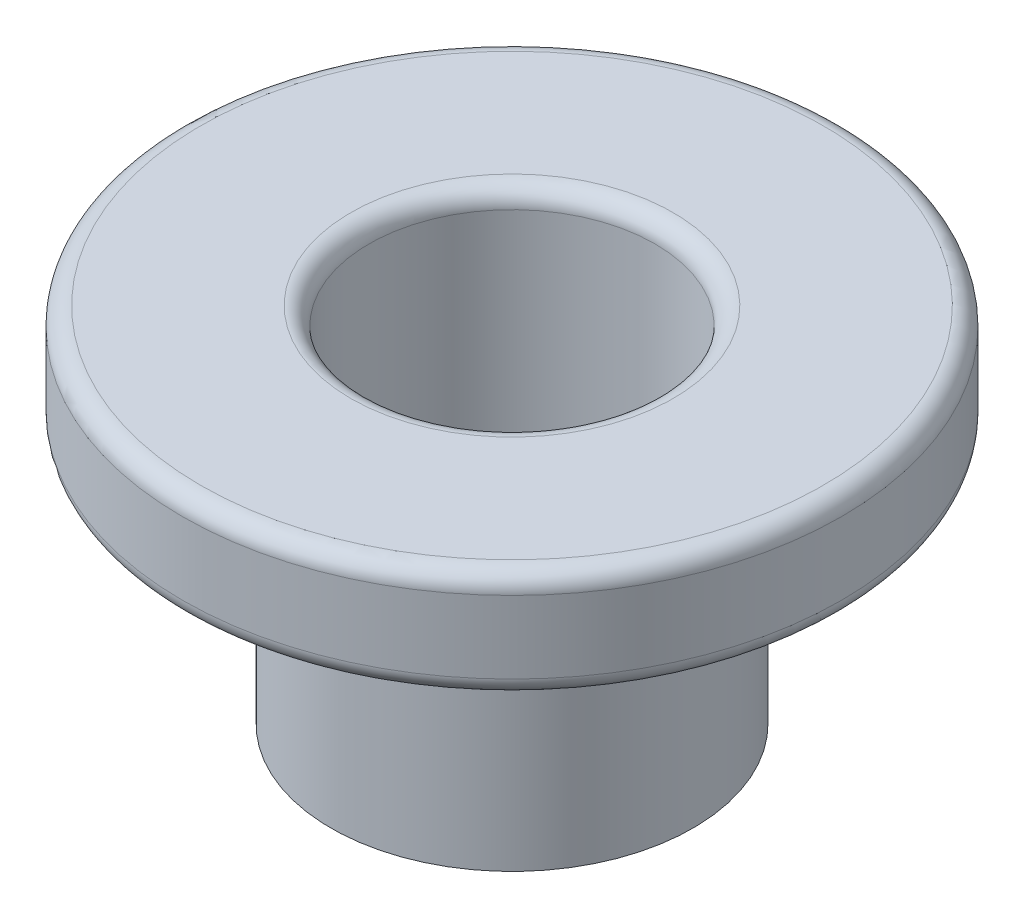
from build123d import *

# Parameters (mm, degrees)
FILLET1_R = 0.254


with BuildPart() as part:
    # Sketch1 → Revolve1 (revolve)
    with BuildSketch(Plane.XY, mode=Mode.PRIVATE) as revolve1_sk:
        Polygon((2.0066, 0), (2.0066, 5.08), (4.6228, 5.08), (4.6228, 3.556), (2.54, 3.556), (2.54, 0), align=None)
    revolve(revolve1_sk.sketch.rotate(Axis((0, 0, 0), (0, 1, 0)), 90), axis=Axis((0, 0, 0), (0, 1, 0)))

    # Fillet1
    fillet1_edges = [part.edges().sort_by_distance(p)[0] for p in [
        (0, 3.556, 4.6228),
        (0, 5.08, 4.6228),
        (0, 5.08, 2.0066),
    ]]
    fillet(fillet1_edges, radius=FILLET1_R)


solid = part.part
